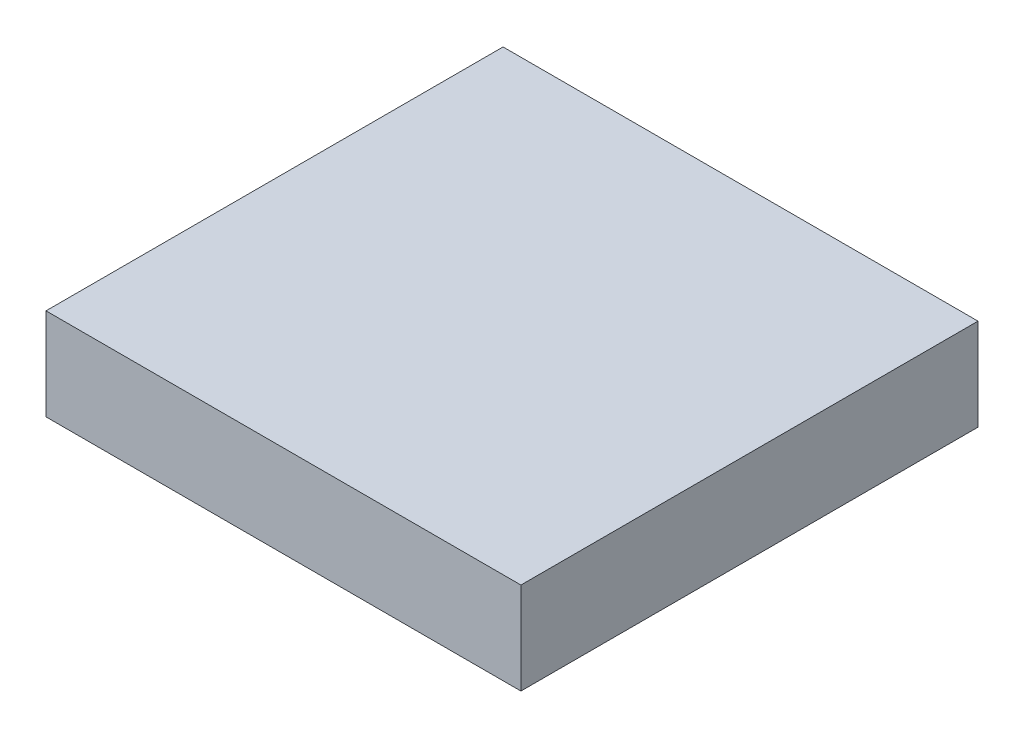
from build123d import *

# Parameters (mm, degrees)
SKETCH1_W           = 203.99445642
SKETCH1_H           = 39.44843569
BOSS_EXTRUDE1_DEPTH = 196.330872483


with BuildPart() as part:
    # Sketch1 → Boss-Extrude1 (new body)
    with BuildSketch(Plane.XY):
        with Locations((101.99722821, 19.724217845)):
            Rectangle(SKETCH1_W, SKETCH1_H)
    extrude(amount=BOSS_EXTRUDE1_DEPTH)


solid = part.part
